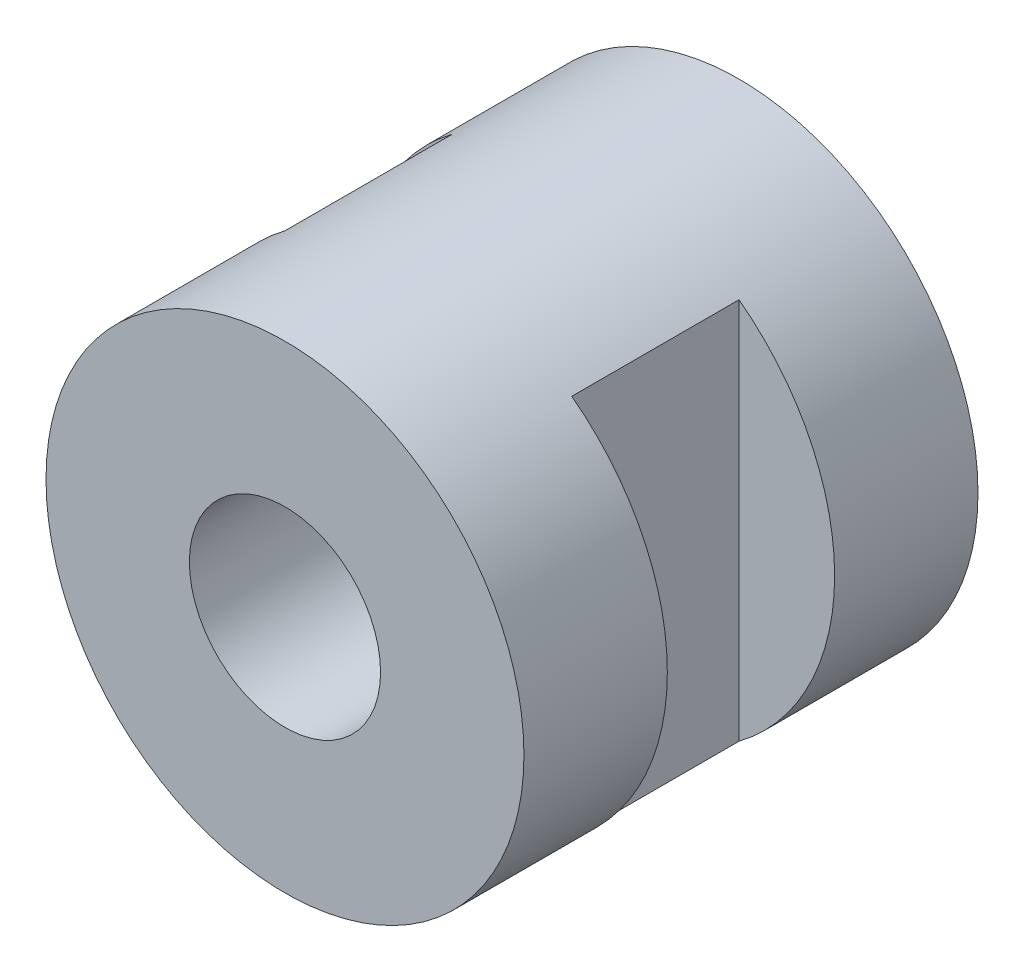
ISO-10303-21;
HEADER;
FILE_DESCRIPTION(('STEP AP214'),'2;1');
FILE_NAME('part.step','',(''),(''),'','','');
FILE_SCHEMA(('AUTOMOTIVE_DESIGN { 1 0 10303 214 1 1 1 1 }'));
ENDSEC;
DATA;
#1=APPLICATION_CONTEXT('core data for automotive mechanical design processes');
#2=APPLICATION_PROTOCOL_DEFINITION('international standard','automotive_design',2000,#1);
#3=PRODUCT_CONTEXT('',#1,'mechanical');
#4=PRODUCT('Part','Part','',(#3));
#5=PRODUCT_RELATED_PRODUCT_CATEGORY('part','',(#4));
#6=PRODUCT_DEFINITION_FORMATION('','',#4);
#7=PRODUCT_DEFINITION_CONTEXT('part definition',#1,'design');
#8=PRODUCT_DEFINITION('design','',#6,#7);
#9=PRODUCT_DEFINITION_SHAPE('','',#8);
#10=(LENGTH_UNIT() NAMED_UNIT(*) SI_UNIT(.MILLI.,.METRE.));
#11=(NAMED_UNIT(*) PLANE_ANGLE_UNIT() SI_UNIT($,.RADIAN.));
#12=(NAMED_UNIT(*) SI_UNIT($,.STERADIAN.) SOLID_ANGLE_UNIT());
#13=UNCERTAINTY_MEASURE_WITH_UNIT(LENGTH_MEASURE(1.E-05),#10,'distance_accuracy_value','');
#14=(GEOMETRIC_REPRESENTATION_CONTEXT(3) GLOBAL_UNCERTAINTY_ASSIGNED_CONTEXT((#13)) GLOBAL_UNIT_ASSIGNED_CONTEXT((#10,
#11,#12)) REPRESENTATION_CONTEXT('',''));
#15=CARTESIAN_POINT('',(0.,0.,0.));
#16=DIRECTION('',(0.,0.,1.));
#17=DIRECTION('',(1.,0.,0.));
#18=AXIS2_PLACEMENT_3D('',#15,#16,#17);
#19=CARTESIAN_POINT('',(0.,0.,9.5));
#20=DIRECTION('',(0.,0.,-1.));
#21=DIRECTION('',(-1.,0.,0.));
#22=AXIS2_PLACEMENT_3D('',#19,#20,#21);
#23=CYLINDRICAL_SURFACE('',#22,5.);
#24=DIRECTION('',(0.,0.,-1.));
#25=VECTOR('',#24,1.);
#26=CARTESIAN_POINT('',(-3.,-4.,9.5));
#27=LINE('',#26,#25);
#28=CARTESIAN_POINT('',(-3.,-4.,6.5));
#29=VERTEX_POINT('',#28);
#30=CARTESIAN_POINT('',(-3.,-4.,3.));
#31=VERTEX_POINT('',#30);
#32=EDGE_CURVE('E39',#29,#31,#27,.T.);
#33=ORIENTED_EDGE('',*,*,#32,.T.);
#34=CARTESIAN_POINT('',(0.,0.,3.));
#35=DIRECTION('',(0.,0.,-1.));
#36=DIRECTION('',(-1.,0.,0.));
#37=AXIS2_PLACEMENT_3D('',#34,#35,#36);
#38=CIRCLE('',#37,5.);
#39=CARTESIAN_POINT('',(-3.,4.,3.));
#40=VERTEX_POINT('',#39);
#41=EDGE_CURVE('E11',#31,#40,#38,.T.);
#42=ORIENTED_EDGE('',*,*,#41,.T.);
#43=DIRECTION('',(0.,0.,-1.));
#44=VECTOR('',#43,1.);
#45=CARTESIAN_POINT('',(-3.,4.,9.5));
#46=LINE('',#45,#44);
#47=CARTESIAN_POINT('',(-3.,4.,6.5));
#48=VERTEX_POINT('',#47);
#49=EDGE_CURVE('E75',#40,#48,#46,.F.);
#50=ORIENTED_EDGE('',*,*,#49,.T.);
#51=CARTESIAN_POINT('',(0.,0.,6.5));
#52=DIRECTION('',(0.,0.,1.));
#53=DIRECTION('',(1.,0.,0.));
#54=AXIS2_PLACEMENT_3D('',#51,#52,#53);
#55=CIRCLE('',#54,5.);
#56=EDGE_CURVE('E70',#48,#29,#55,.T.);
#57=ORIENTED_EDGE('',*,*,#56,.T.);
#58=EDGE_LOOP('',(#33,#42,#50,#57));
#59=FACE_BOUND('',#58,.T.);
#60=DIRECTION('',(0.,0.,-1.));
#61=VECTOR('',#60,1.);
#62=CARTESIAN_POINT('',(3.,-4.,9.5));
#63=LINE('',#62,#61);
#64=CARTESIAN_POINT('',(3.,-4.,3.));
#65=VERTEX_POINT('',#64);
#66=CARTESIAN_POINT('',(3.,-4.,6.5));
#67=VERTEX_POINT('',#66);
#68=EDGE_CURVE('E93',#65,#67,#63,.F.);
#69=ORIENTED_EDGE('',*,*,#68,.T.);
#70=CARTESIAN_POINT('',(0.,0.,6.5));
#71=DIRECTION('',(0.,0.,1.));
#72=DIRECTION('',(1.,0.,0.));
#73=AXIS2_PLACEMENT_3D('',#70,#71,#72);
#74=CIRCLE('',#73,5.);
#75=CARTESIAN_POINT('',(3.,4.,6.5));
#76=VERTEX_POINT('',#75);
#77=EDGE_CURVE('E76',#67,#76,#74,.T.);
#78=ORIENTED_EDGE('',*,*,#77,.T.);
#79=DIRECTION('',(0.,0.,-1.));
#80=VECTOR('',#79,1.);
#81=CARTESIAN_POINT('',(3.,4.,9.5));
#82=LINE('',#81,#80);
#83=CARTESIAN_POINT('',(3.,4.,3.));
#84=VERTEX_POINT('',#83);
#85=EDGE_CURVE('E90',#76,#84,#82,.T.);
#86=ORIENTED_EDGE('',*,*,#85,.T.);
#87=CARTESIAN_POINT('',(0.,0.,3.));
#88=DIRECTION('',(0.,0.,-1.));
#89=DIRECTION('',(-1.,0.,0.));
#90=AXIS2_PLACEMENT_3D('',#87,#88,#89);
#91=CIRCLE('',#90,5.);
#92=EDGE_CURVE('E96',#84,#65,#91,.T.);
#93=ORIENTED_EDGE('',*,*,#92,.T.);
#94=EDGE_LOOP('',(#69,#78,#86,#93));
#95=FACE_BOUND('',#94,.T.);
#96=CARTESIAN_POINT('',(0.,0.,9.5));
#97=DIRECTION('',(0.,0.,1.));
#98=DIRECTION('',(1.,0.,0.));
#99=AXIS2_PLACEMENT_3D('',#96,#97,#98);
#100=CIRCLE('',#99,5.);
#101=CARTESIAN_POINT('',(5.,0.,9.5));
#102=VERTEX_POINT('',#101);
#103=EDGE_CURVE('E99',#102,#102,#100,.T.);
#104=ORIENTED_EDGE('',*,*,#103,.F.);
#105=EDGE_LOOP('',(#104));
#106=FACE_BOUND('',#105,.T.);
#107=CARTESIAN_POINT('',(0.,0.,0.));
#108=DIRECTION('',(0.,0.,1.));
#109=DIRECTION('',(1.,0.,0.));
#110=AXIS2_PLACEMENT_3D('',#107,#108,#109);
#111=CIRCLE('',#110,5.);
#112=CARTESIAN_POINT('',(5.,0.,0.));
#113=VERTEX_POINT('',#112);
#114=EDGE_CURVE('E100',#113,#113,#111,.T.);
#115=ORIENTED_EDGE('',*,*,#114,.T.);
#116=EDGE_LOOP('',(#115));
#117=FACE_BOUND('',#116,.T.);
#118=ADVANCED_FACE('F32',(#59,#95,#106,#117),#23,.T.);
#119=CARTESIAN_POINT('',(0.,0.,9.5));
#120=DIRECTION('',(0.,0.,1.));
#121=DIRECTION('',(1.,0.,0.));
#122=AXIS2_PLACEMENT_3D('',#119,#120,#121);
#123=PLANE('',#122);
#124=CARTESIAN_POINT('',(0.,0.,9.5));
#125=DIRECTION('',(0.,0.,-1.));
#126=DIRECTION('',(-1.,0.,0.));
#127=AXIS2_PLACEMENT_3D('',#124,#125,#126);
#128=CIRCLE('',#127,2.);
#129=CARTESIAN_POINT('',(-2.,0.,9.5));
#130=VERTEX_POINT('',#129);
#131=EDGE_CURVE('E83',#130,#130,#128,.T.);
#132=ORIENTED_EDGE('',*,*,#131,.T.);
#133=EDGE_LOOP('',(#132));
#134=FACE_BOUND('',#133,.T.);
#135=ORIENTED_EDGE('',*,*,#103,.T.);
#136=EDGE_LOOP('',(#135));
#137=FACE_BOUND('',#136,.T.);
#138=ADVANCED_FACE('F116',(#134,#137),#123,.T.);
#139=CARTESIAN_POINT('',(0.,0.,0.));
#140=DIRECTION('',(0.,0.,1.));
#141=DIRECTION('',(1.,0.,0.));
#142=AXIS2_PLACEMENT_3D('',#139,#140,#141);
#143=PLANE('',#142);
#144=CARTESIAN_POINT('',(0.,0.,0.));
#145=DIRECTION('',(0.,0.,-1.));
#146=DIRECTION('',(-1.,0.,0.));
#147=AXIS2_PLACEMENT_3D('',#144,#145,#146);
#148=CIRCLE('',#147,2.);
#149=CARTESIAN_POINT('',(-2.,0.,0.));
#150=VERTEX_POINT('',#149);
#151=EDGE_CURVE('E110',#150,#150,#148,.T.);
#152=ORIENTED_EDGE('',*,*,#151,.F.);
#153=EDGE_LOOP('',(#152));
#154=FACE_BOUND('',#153,.T.);
#155=ORIENTED_EDGE('',*,*,#114,.F.);
#156=EDGE_LOOP('',(#155));
#157=FACE_BOUND('',#156,.T.);
#158=ADVANCED_FACE('F125',(#154,#157),#143,.F.);
#159=CARTESIAN_POINT('',(5.38366429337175,-5.,6.5));
#160=DIRECTION('',(0.,0.,1.));
#161=DIRECTION('',(1.,0.,0.));
#162=AXIS2_PLACEMENT_3D('',#159,#160,#161);
#163=PLANE('',#162);
#164=DIRECTION('',(0.,1.,0.));
#165=VECTOR('',#164,1.);
#166=CARTESIAN_POINT('',(3.,-5.,6.5));
#167=LINE('',#166,#165);
#168=EDGE_CURVE('E103',#67,#76,#167,.T.);
#169=ORIENTED_EDGE('',*,*,#168,.T.);
#170=ORIENTED_EDGE('',*,*,#77,.F.);
#171=EDGE_LOOP('',(#169,#170));
#172=FACE_BOUND('',#171,.T.);
#173=ADVANCED_FACE('F128',(#172),#163,.F.);
#174=CARTESIAN_POINT('',(3.,-5.,6.5));
#175=DIRECTION('',(-1.,0.,0.));
#176=DIRECTION('',(0.,0.,1.));
#177=AXIS2_PLACEMENT_3D('',#174,#175,#176);
#178=PLANE('',#177);
#179=ORIENTED_EDGE('',*,*,#168,.F.);
#180=ORIENTED_EDGE('',*,*,#68,.F.);
#181=DIRECTION('',(0.,1.,0.));
#182=VECTOR('',#181,1.);
#183=CARTESIAN_POINT('',(3.,-5.,3.));
#184=LINE('',#183,#182);
#185=EDGE_CURVE('E52',#65,#84,#184,.T.);
#186=ORIENTED_EDGE('',*,*,#185,.T.);
#187=ORIENTED_EDGE('',*,*,#85,.F.);
#188=EDGE_LOOP('',(#179,#180,#186,#187));
#189=FACE_BOUND('',#188,.T.);
#190=ADVANCED_FACE('F143',(#189),#178,.F.);
#191=CARTESIAN_POINT('',(5.38366429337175,-5.,3.));
#192=DIRECTION('',(0.,0.,-1.));
#193=DIRECTION('',(-1.,0.,0.));
#194=AXIS2_PLACEMENT_3D('',#191,#192,#193);
#195=PLANE('',#194);
#196=ORIENTED_EDGE('',*,*,#185,.F.);
#197=ORIENTED_EDGE('',*,*,#92,.F.);
#198=EDGE_LOOP('',(#196,#197));
#199=FACE_BOUND('',#198,.T.);
#200=ADVANCED_FACE('F139',(#199),#195,.F.);
#201=CARTESIAN_POINT('',(-5.38366429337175,-5.,3.));
#202=DIRECTION('',(0.,0.,-1.));
#203=DIRECTION('',(-1.,0.,0.));
#204=AXIS2_PLACEMENT_3D('',#201,#202,#203);
#205=PLANE('',#204);
#206=DIRECTION('',(0.,1.,0.));
#207=VECTOR('',#206,1.);
#208=CARTESIAN_POINT('',(-3.,-5.,3.));
#209=LINE('',#208,#207);
#210=EDGE_CURVE('E82',#31,#40,#209,.T.);
#211=ORIENTED_EDGE('',*,*,#210,.T.);
#212=ORIENTED_EDGE('',*,*,#41,.F.);
#213=EDGE_LOOP('',(#211,#212));
#214=FACE_BOUND('',#213,.T.);
#215=ADVANCED_FACE('F142',(#214),#205,.F.);
#216=CARTESIAN_POINT('',(-3.,-5.,6.5));
#217=DIRECTION('',(1.,0.,0.));
#218=DIRECTION('',(0.,0.,-1.));
#219=AXIS2_PLACEMENT_3D('',#216,#217,#218);
#220=PLANE('',#219);
#221=DIRECTION('',(0.,1.,0.));
#222=VECTOR('',#221,1.);
#223=CARTESIAN_POINT('',(-3.,-5.,6.5));
#224=LINE('',#223,#222);
#225=EDGE_CURVE('E45',#29,#48,#224,.T.);
#226=ORIENTED_EDGE('',*,*,#225,.T.);
#227=ORIENTED_EDGE('',*,*,#49,.F.);
#228=ORIENTED_EDGE('',*,*,#210,.F.);
#229=ORIENTED_EDGE('',*,*,#32,.F.);
#230=EDGE_LOOP('',(#226,#227,#228,#229));
#231=FACE_BOUND('',#230,.T.);
#232=ADVANCED_FACE('F79',(#231),#220,.F.);
#233=CARTESIAN_POINT('',(-5.38366429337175,-5.,6.5));
#234=DIRECTION('',(0.,0.,1.));
#235=DIRECTION('',(1.,0.,0.));
#236=AXIS2_PLACEMENT_3D('',#233,#234,#235);
#237=PLANE('',#236);
#238=ORIENTED_EDGE('',*,*,#225,.F.);
#239=ORIENTED_EDGE('',*,*,#56,.F.);
#240=EDGE_LOOP('',(#238,#239));
#241=FACE_BOUND('',#240,.T.);
#242=ADVANCED_FACE('F71',(#241),#237,.F.);
#243=CARTESIAN_POINT('',(0.,0.,9.5));
#244=DIRECTION('',(0.,0.,-1.));
#245=DIRECTION('',(-1.,0.,0.));
#246=AXIS2_PLACEMENT_3D('',#243,#244,#245);
#247=CYLINDRICAL_SURFACE('',#246,2.);
#248=ORIENTED_EDGE('',*,*,#131,.F.);
#249=EDGE_LOOP('',(#248));
#250=FACE_BOUND('',#249,.T.);
#251=ORIENTED_EDGE('',*,*,#151,.T.);
#252=EDGE_LOOP('',(#251));
#253=FACE_BOUND('',#252,.T.);
#254=ADVANCED_FACE('F119',(#250,#253),#247,.F.);
#255=CLOSED_SHELL('',(#118,#138,#158,#173,#190,#200,#215,#232,#242,#254));
#256=MANIFOLD_SOLID_BREP('B2',#255);
#257=ADVANCED_BREP_SHAPE_REPRESENTATION('',(#18,#256),#14);
#258=SHAPE_DEFINITION_REPRESENTATION(#9,#257);
ENDSEC;
END-ISO-10303-21;
